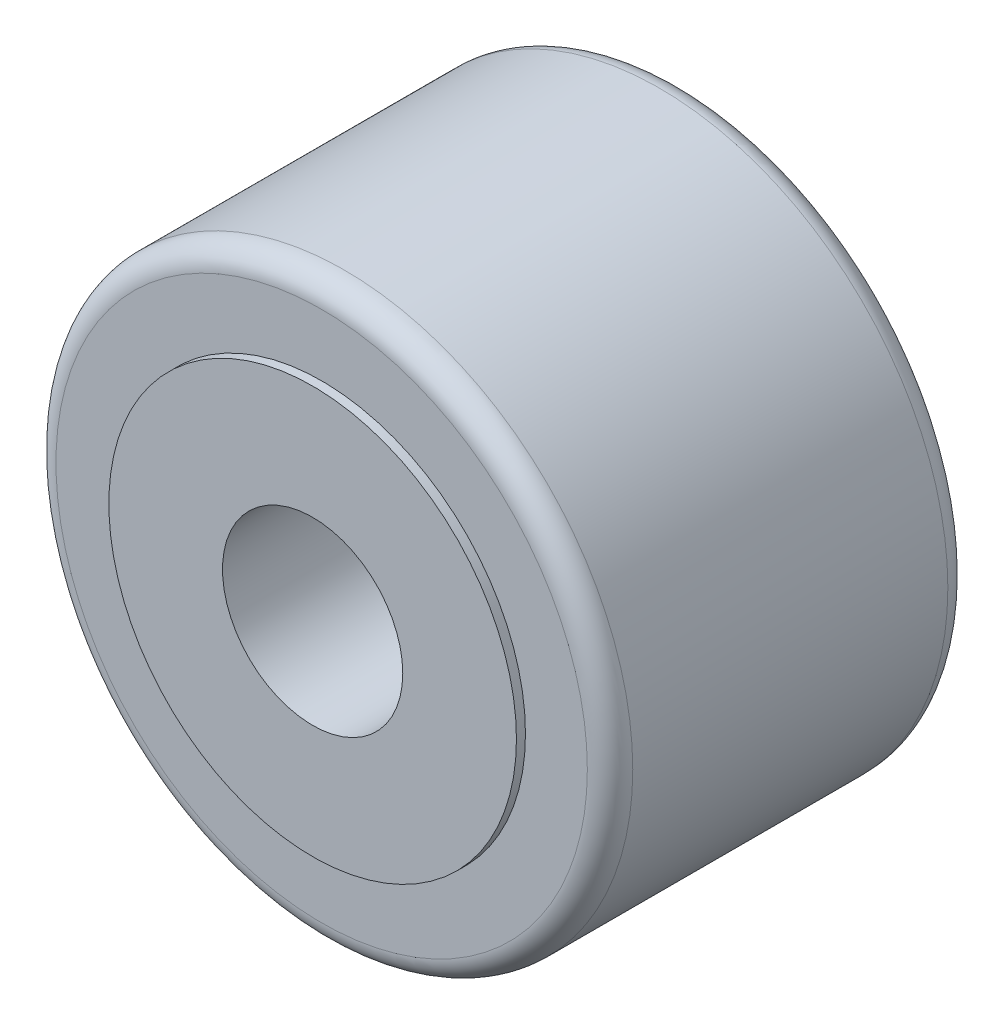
from build123d import *

# Parameters (mm, degrees)
EXTRUDE1_DEPTH      = 15.875
EXTRUDE1_DEPTH_BACK = 15.875
SKETCH1_R           = 25.4
EXTRUDE2_DEPTH      = 16.669
EXTRUDE2_DEPTH_BACK = 16.669
SKETCH2_R           = 17.95
EXTRUDE3_DEPTH      = 40.600196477
EXTRUDE3_DEPTH_BACK = 40.600196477
SKETCH3_R           = 7.9375
FILLET1_R           = 2


with BuildPart() as part:
    # Sketch1 → Extrude1 (new, two sides: drawn at the far end of the back side and taken through both)
    with BuildSketch(Plane.XY.offset(-EXTRUDE1_DEPTH_BACK)):
        Circle(SKETCH1_R)
    extrude(amount=EXTRUDE1_DEPTH + EXTRUDE1_DEPTH_BACK)

    # Sketch2 → Extrude2 (add, two sides: drawn at the far end of the back side and taken through both)
    with BuildSketch(Plane.XY.offset(-EXTRUDE2_DEPTH_BACK)):
        Circle(SKETCH2_R)
    extrude(amount=EXTRUDE2_DEPTH + EXTRUDE2_DEPTH_BACK)

    # Sketch3 → Extrude3 (cut, two sides: drawn at the far end of the back side and taken through both)
    with BuildSketch(Plane.XY.offset(-EXTRUDE3_DEPTH_BACK)):
        Circle(SKETCH3_R)
    extrude(amount=EXTRUDE3_DEPTH + EXTRUDE3_DEPTH_BACK, mode=Mode.SUBTRACT)

    # Fillet1
    fillet1_edges = [part.edges().sort_by_distance(p)[0] for p in [
        (-25.4, 0, -15.875),
        (-25.4, 0, 15.875),
    ]]
    fillet(fillet1_edges, radius=FILLET1_R)


solid = part.part
